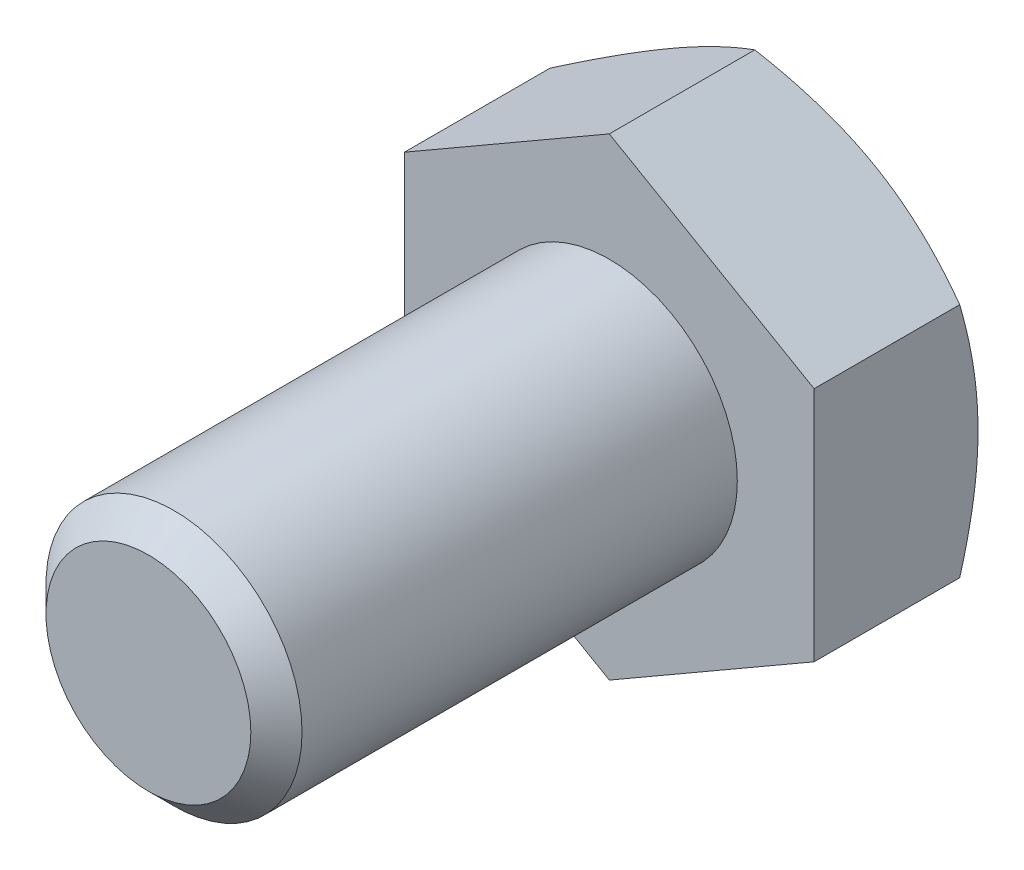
ISO-10303-21;
HEADER;
FILE_DESCRIPTION(('STEP AP214'),'2;1');
FILE_NAME('part.step','',(''),(''),'','','');
FILE_SCHEMA(('AUTOMOTIVE_DESIGN { 1 0 10303 214 1 1 1 1 }'));
ENDSEC;
DATA;
#1=APPLICATION_CONTEXT('core data for automotive mechanical design processes');
#2=APPLICATION_PROTOCOL_DEFINITION('international standard','automotive_design',2000,#1);
#3=PRODUCT_CONTEXT('',#1,'mechanical');
#4=PRODUCT('Part','Part','',(#3));
#5=PRODUCT_RELATED_PRODUCT_CATEGORY('part','',(#4));
#6=PRODUCT_DEFINITION_FORMATION('','',#4);
#7=PRODUCT_DEFINITION_CONTEXT('part definition',#1,'design');
#8=PRODUCT_DEFINITION('design','',#6,#7);
#9=PRODUCT_DEFINITION_SHAPE('','',#8);
#10=(LENGTH_UNIT() NAMED_UNIT(*) SI_UNIT(.MILLI.,.METRE.));
#11=(NAMED_UNIT(*) PLANE_ANGLE_UNIT() SI_UNIT($,.RADIAN.));
#12=(NAMED_UNIT(*) SI_UNIT($,.STERADIAN.) SOLID_ANGLE_UNIT());
#13=UNCERTAINTY_MEASURE_WITH_UNIT(LENGTH_MEASURE(1.E-05),#10,'distance_accuracy_value','');
#14=(GEOMETRIC_REPRESENTATION_CONTEXT(3) GLOBAL_UNCERTAINTY_ASSIGNED_CONTEXT((#13)) GLOBAL_UNIT_ASSIGNED_CONTEXT((#10,
#11,#12)) REPRESENTATION_CONTEXT('',''));
#15=CARTESIAN_POINT('',(0.,0.,0.));
#16=DIRECTION('',(0.,0.,1.));
#17=DIRECTION('',(1.,0.,0.));
#18=AXIS2_PLACEMENT_3D('',#15,#16,#17);
#19=CARTESIAN_POINT('',(0.,0.,18.));
#20=DIRECTION('',(0.,0.,1.));
#21=DIRECTION('',(1.,0.,0.));
#22=AXIS2_PLACEMENT_3D('',#19,#20,#21);
#23=PLANE('',#22);
#24=CARTESIAN_POINT('',(0.,0.,18.));
#25=DIRECTION('',(0.,0.,1.));
#26=DIRECTION('',(1.,0.,0.));
#27=AXIS2_PLACEMENT_3D('',#24,#25,#26);
#28=CIRCLE('',#27,4.);
#29=CARTESIAN_POINT('',(4.,0.,18.));
#30=VERTEX_POINT('',#29);
#31=EDGE_CURVE('E205',#30,#30,#28,.T.);
#32=ORIENTED_EDGE('',*,*,#31,.T.);
#33=EDGE_LOOP('',(#32));
#34=FACE_BOUND('',#33,.T.);
#35=ADVANCED_FACE('F31',(#34),#23,.T.);
#36=CARTESIAN_POINT('',(0.,0.,0.));
#37=DIRECTION('',(0.,0.,1.));
#38=DIRECTION('',(1.,0.,0.));
#39=AXIS2_PLACEMENT_3D('',#36,#37,#38);
#40=CYLINDRICAL_SURFACE('',#39,5.);
#41=CARTESIAN_POINT('',(0.,0.,17.));
#42=DIRECTION('',(0.,0.,1.));
#43=DIRECTION('',(1.,0.,0.));
#44=AXIS2_PLACEMENT_3D('',#41,#42,#43);
#45=CIRCLE('',#44,5.);
#46=CARTESIAN_POINT('',(5.,0.,17.));
#47=VERTEX_POINT('',#46);
#48=EDGE_CURVE('E207',#47,#47,#45,.F.);
#49=ORIENTED_EDGE('',*,*,#48,.T.);
#50=EDGE_LOOP('',(#49));
#51=FACE_BOUND('',#50,.T.);
#52=CARTESIAN_POINT('',(0.,0.,0.));
#53=DIRECTION('',(0.,0.,1.));
#54=DIRECTION('',(1.,0.,0.));
#55=AXIS2_PLACEMENT_3D('',#52,#53,#54);
#56=CIRCLE('',#55,5.);
#57=CARTESIAN_POINT('',(5.,0.,0.));
#58=VERTEX_POINT('',#57);
#59=EDGE_CURVE('E208',#58,#58,#56,.F.);
#60=ORIENTED_EDGE('',*,*,#59,.F.);
#61=EDGE_LOOP('',(#60));
#62=FACE_BOUND('',#61,.T.);
#63=ADVANCED_FACE('F196',(#51,#62),#40,.T.);
#64=CARTESIAN_POINT('',(0.,0.,18.));
#65=DIRECTION('',(0.,0.,-1.));
#66=DIRECTION('',(-1.,0.,0.));
#67=AXIS2_PLACEMENT_3D('',#64,#65,#66);
#68=CONICAL_SURFACE('',#67,4.,0.785398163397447);
#69=ORIENTED_EDGE('',*,*,#48,.F.);
#70=EDGE_LOOP('',(#69));
#71=FACE_BOUND('',#70,.T.);
#72=ORIENTED_EDGE('',*,*,#31,.F.);
#73=EDGE_LOOP('',(#72));
#74=FACE_BOUND('',#73,.T.);
#75=ADVANCED_FACE('F201',(#71,#74),#68,.T.);
#76=CARTESIAN_POINT('',(0.,9.23760430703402,-6.4));
#77=DIRECTION('',(0.499999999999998,0.86602540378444,0.));
#78=DIRECTION('',(-0.86602540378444,0.499999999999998,0.));
#79=AXIS2_PLACEMENT_3D('',#76,#77,#78);
#80=PLANE('',#79);
#81=CARTESIAN_POINT('',(-0.000200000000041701,9.23771977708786,-5.68540215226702));
#82=CARTESIAN_POINT('',(0.175648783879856,9.13619343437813,-5.74400928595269));
#83=CARTESIAN_POINT('',(0.352153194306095,9.03428856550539,-5.7999565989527));
#84=CARTESIAN_POINT('',(0.70659546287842,8.82965122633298,-5.90579899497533));
#85=CARTESIAN_POINT('',(0.884533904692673,8.72691841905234,-5.95569146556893));
#86=CARTESIAN_POINT('',(1.42119823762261,8.41707512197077,-6.09530720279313));
#87=CARTESIAN_POINT('',(1.78204258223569,8.20874154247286,-6.17471882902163));
#88=CARTESIAN_POINT('',(2.32203917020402,7.89697436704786,-6.26783835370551));
#89=CARTESIAN_POINT('',(2.49957818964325,7.79447216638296,-6.29436541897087));
#90=CARTESIAN_POINT('',(2.85545911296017,7.58900421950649,-6.33884682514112));
#91=CARTESIAN_POINT('',(3.03380094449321,7.48603851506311,-6.35680192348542));
#92=CARTESIAN_POINT('',(3.39079168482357,7.27992981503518,-6.38368435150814));
#93=CARTESIAN_POINT('',(3.56944001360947,7.17678715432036,-6.39262192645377));
#94=CARTESIAN_POINT('',(3.92690170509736,6.97040655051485,-6.40127769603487));
#95=CARTESIAN_POINT('',(4.10571506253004,6.86716861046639,-6.40099617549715));
#96=CARTESIAN_POINT('',(4.44001336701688,6.67416139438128,-6.39185497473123));
#97=CARTESIAN_POINT('',(4.59552190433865,6.58437849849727,-6.38411039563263));
#98=CARTESIAN_POINT('',(4.90617476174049,6.4050229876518,-6.36179886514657));
#99=CARTESIAN_POINT('',(5.06131905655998,6.31545038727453,-6.34723145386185));
#100=CARTESIAN_POINT('',(5.5261513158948,6.04707935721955,-6.29363930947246));
#101=CARTESIAN_POINT('',(5.8350164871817,5.86875596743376,-6.24473135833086));
#102=CARTESIAN_POINT('',(6.45602322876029,5.51021755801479,-6.12246059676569));
#103=CARTESIAN_POINT('',(6.76808554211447,5.33004829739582,-6.048579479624));
#104=CARTESIAN_POINT('',(7.38755648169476,4.97239658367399,-5.88089985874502));
#105=CARTESIAN_POINT('',(7.69497304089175,4.79490955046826,-5.78714073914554));
#106=CARTESIAN_POINT('',(8.0002,4.61868668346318,-5.68540215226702));
#107=B_SPLINE_CURVE_WITH_KNOTS('',3,(#81,#82,#83,#84,#85,#86,#87,#88,#89,#90,#91,#92,#93,#94,
#95,#96,#97,#98,#99,#100,#101,#102,#103,#104,#105,#106),.UNSPECIFIED.,.F.,.F.,(4,2,2,2,2,2,2,2,
2,2,2,2,4),(0.,0.633973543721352,1.26821965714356,2.53934712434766,3.1593434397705,
3.77928496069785,4.39852133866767,5.01773858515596,5.5568023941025,6.09590254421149,
7.17487077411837,8.27776850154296,9.37850115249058),.UNSPECIFIED.);
#108=CARTESIAN_POINT('',(0.,9.23760430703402,-5.68546882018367));
#109=VERTEX_POINT('',#108);
#110=CARTESIAN_POINT('',(3.99999999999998,6.92820323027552,-6.4));
#111=VERTEX_POINT('',#110);
#112=EDGE_CURVE('E241',#109,#111,#107,.T.);
#113=ORIENTED_EDGE('',*,*,#112,.F.);
#114=DIRECTION('',(0.,0.,1.));
#115=VECTOR('',#114,1.);
#116=CARTESIAN_POINT('',(0.,9.23760430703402,-6.4));
#117=LINE('',#116,#115);
#118=CARTESIAN_POINT('',(0.,9.23760430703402,0.));
#119=VERTEX_POINT('',#118);
#120=EDGE_CURVE('E215',#109,#119,#117,.T.);
#121=ORIENTED_EDGE('',*,*,#120,.T.);
#122=DIRECTION('',(-0.86602540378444,0.499999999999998,0.));
#123=VECTOR('',#122,1.);
#124=CARTESIAN_POINT('',(0.,9.23760430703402,0.));
#125=LINE('',#124,#123);
#126=CARTESIAN_POINT('',(8.,4.61880215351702,0.));
#127=VERTEX_POINT('',#126);
#128=EDGE_CURVE('E239',#127,#119,#125,.T.);
#129=ORIENTED_EDGE('',*,*,#128,.F.);
#130=DIRECTION('',(0.,0.,1.));
#131=VECTOR('',#130,1.);
#132=CARTESIAN_POINT('',(8.,4.61880215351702,-6.4));
#133=LINE('',#132,#131);
#134=CARTESIAN_POINT('',(8.,4.61880215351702,-5.68546882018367));
#135=VERTEX_POINT('',#134);
#136=EDGE_CURVE('E212',#135,#127,#133,.T.);
#137=ORIENTED_EDGE('',*,*,#136,.F.);
#138=EDGE_CURVE('E171',#111,#135,#107,.T.);
#139=ORIENTED_EDGE('',*,*,#138,.F.);
#140=EDGE_LOOP('',(#113,#121,#129,#137,#139));
#141=FACE_BOUND('',#140,.T.);
#142=ADVANCED_FACE('F181',(#141),#80,.T.);
#143=CARTESIAN_POINT('',(8.,-4.61880215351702,-6.4));
#144=DIRECTION('',(1.,0.,0.));
#145=DIRECTION('',(0.,0.,-1.));
#146=AXIS2_PLACEMENT_3D('',#143,#144,#145);
#147=PLANE('',#146);
#148=CARTESIAN_POINT('',(8.,-12.5978512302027,-2.40281206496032));
#149=CARTESIAN_POINT('',(8.,-12.246746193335,-2.57388946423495));
#150=CARTESIAN_POINT('',(8.,-11.8948553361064,-2.74338074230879));
#151=CARTESIAN_POINT('',(8.,-11.1890846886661,-3.07830251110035));
#152=CARTESIAN_POINT('',(8.,-10.835204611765,-3.24373239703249));
#153=CARTESIAN_POINT('',(8.,-10.1233054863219,-3.57043443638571));
#154=CARTESIAN_POINT('',(8.,-9.76527449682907,-3.73168065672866));
#155=CARTESIAN_POINT('',(8.,-9.04643054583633,-4.04782365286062));
#156=CARTESIAN_POINT('',(8.,-8.68561771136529,-4.20272071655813));
#157=CARTESIAN_POINT('',(8.,-7.94836823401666,-4.50960168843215));
#158=CARTESIAN_POINT('',(8.,-7.57181608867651,-4.66130959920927));
#159=CARTESIAN_POINT('',(8.,-6.81437869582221,-4.95369969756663));
#160=CARTESIAN_POINT('',(8.,-6.43349297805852,-5.09438067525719));
#161=CARTESIAN_POINT('',(8.,-5.66743059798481,-5.36116349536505));
#162=CARTESIAN_POINT('',(8.,-5.28226375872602,-5.48729325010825));
#163=CARTESIAN_POINT('',(8.,-4.50642197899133,-5.72105487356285));
#164=CARTESIAN_POINT('',(8.,-4.11574875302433,-5.82869236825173));
#165=CARTESIAN_POINT('',(8.,-3.33076858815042,-6.01985550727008));
#166=CARTESIAN_POINT('',(8.,-2.9364953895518,-6.10351603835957));
#167=CARTESIAN_POINT('',(8.,-2.34134760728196,-6.20749259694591));
#168=CARTESIAN_POINT('',(8.,-2.14232908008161,-6.23856705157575));
#169=CARTESIAN_POINT('',(8.,-1.7432391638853,-6.29294025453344));
#170=CARTESIAN_POINT('',(8.,-1.54316787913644,-6.31623975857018));
#171=CARTESIAN_POINT('',(8.,-1.14493807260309,-6.35429623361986));
#172=CARTESIAN_POINT('',(8.,-0.946790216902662,-6.36916434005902));
#173=CARTESIAN_POINT('',(8.,-0.550042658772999,-6.39050002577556));
#174=CARTESIAN_POINT('',(8.,-0.351442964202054,-6.39696775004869));
#175=CARTESIAN_POINT('',(8.,0.0458536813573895,-6.40134753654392));
#176=CARTESIAN_POINT('',(8.,0.244550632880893,-6.39925955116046));
#177=CARTESIAN_POINT('',(8.,0.641675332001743,-6.38658102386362));
#178=CARTESIAN_POINT('',(8.,0.840103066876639,-6.37599009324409));
#179=CARTESIAN_POINT('',(8.,1.31123186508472,-6.3409781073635));
#180=CARTESIAN_POINT('',(8.,1.58366327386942,-6.31284309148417));
#181=CARTESIAN_POINT('',(8.,2.12661564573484,-6.24203710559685));
#182=CARTESIAN_POINT('',(8.,2.39713636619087,-6.19936432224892));
#183=CARTESIAN_POINT('',(8.,3.20545284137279,-6.0517930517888));
#184=CARTESIAN_POINT('',(8.,3.73973646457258,-5.92736416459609));
#185=CARTESIAN_POINT('',(8.,4.53906436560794,-5.71012995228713));
#186=CARTESIAN_POINT('',(8.,4.80821183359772,-5.63154182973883));
#187=CARTESIAN_POINT('',(8.,5.34389592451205,-5.46584170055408));
#188=CARTESIAN_POINT('',(8.,5.61043252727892,-5.37872962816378));
#189=CARTESIAN_POINT('',(8.,6.14097486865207,-5.1974091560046));
#190=CARTESIAN_POINT('',(8.,6.40498129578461,-5.10320275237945));
#191=CARTESIAN_POINT('',(8.,6.93077992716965,-4.90883812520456));
#192=CARTESIAN_POINT('',(8.,7.19257218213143,-4.8086800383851));
#193=CARTESIAN_POINT('',(8.,7.89757234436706,-4.53123135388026));
#194=CARTESIAN_POINT('',(8.,8.33892089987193,-4.34922056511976));
#195=CARTESIAN_POINT('',(8.,9.21706508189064,-3.97449001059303));
#196=CARTESIAN_POINT('',(8.,9.6538601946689,-3.78176905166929));
#197=CARTESIAN_POINT('',(8.,10.5239434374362,-3.38815487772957));
#198=CARTESIAN_POINT('',(8.,10.9572301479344,-3.18725853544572));
#199=CARTESIAN_POINT('',(8.,11.8208356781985,-2.77925077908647));
#200=CARTESIAN_POINT('',(8.,12.251154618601,-2.57213961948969));
#201=CARTESIAN_POINT('',(8.,13.1101061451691,-2.15271844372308));
#202=CARTESIAN_POINT('',(8.,13.5387348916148,-1.94040058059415));
#203=CARTESIAN_POINT('',(8.,14.3940561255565,-1.51189757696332));
#204=CARTESIAN_POINT('',(8.,14.8207485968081,-1.29571240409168));
#205=CARTESIAN_POINT('',(8.,15.672448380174,-0.860283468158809));
#206=CARTESIAN_POINT('',(8.,16.0974560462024,-0.641040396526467));
#207=CARTESIAN_POINT('',(8.,16.9461557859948,-0.200021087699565));
#208=CARTESIAN_POINT('',(8.,17.3698478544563,0.0217551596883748));
#209=CARTESIAN_POINT('',(8.,18.5495919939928,0.642968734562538));
#210=CARTESIAN_POINT('',(8.,19.3044430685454,1.04468640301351));
#211=CARTESIAN_POINT('',(8.,20.8116128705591,1.85294502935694));
#212=CARTESIAN_POINT('',(8.,21.5639314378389,2.25948628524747));
#213=CARTESIAN_POINT('',(8.,23.0640825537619,3.07479055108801));
#214=CARTESIAN_POINT('',(8.,23.8119216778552,3.48354147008));
#215=CARTESIAN_POINT('',(8.,24.9325210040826,4.09870759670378));
#216=CARTESIAN_POINT('',(8.,25.3058462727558,4.30409483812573));
#217=CARTESIAN_POINT('',(8.,26.0521604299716,4.71547851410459));
#218=CARTESIAN_POINT('',(8.,26.4251493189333,4.92147494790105));
#219=CARTESIAN_POINT('',(8.,26.7979906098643,5.12773824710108));
#220=B_SPLINE_CURVE_WITH_KNOTS('',3,(#148,#149,#150,#151,#152,#153,#154,#155,#156,#157,#158,
#159,#160,#161,#162,#163,#164,#165,#166,#167,#168,#169,#170,#171,#172,#173,#174,#175,#176,#177,
#178,#179,#180,#181,#182,#183,#184,#185,#186,#187,#188,#189,#190,#191,#192,#193,#194,#195,#196,
#197,#198,#199,#200,#201,#202,#203,#204,#205,#206,#207,#208,#209,#210,#211,#212,#213,#214,#215,
#216,#217,#218,#219),.UNSPECIFIED.,.F.,.F.,(4,2,2,2,2,2,2,2,2,2,2,2,2,2,2,2,2,2,2,2,2,2,2,2,2,2,
2,2,2,2,2,2,2,2,2,4),(0.,1.17171303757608,2.34359951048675,3.52154779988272,4.69944261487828,
5.91720060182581,7.13509201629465,8.35060698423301,9.56575149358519,10.7739194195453,
11.3780811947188,11.982184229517,12.5781274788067,13.1740604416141,13.7699967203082,
14.3659602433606,15.1871414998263,16.0084252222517,17.651791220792,18.4928743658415,
19.3339639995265,20.1748178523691,21.0156523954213,22.4476587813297,23.8798250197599,
25.312544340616,26.7452050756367,28.1801767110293,29.6151603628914,31.0498246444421,
32.48449470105,35.0497345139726,37.6151336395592,40.1718943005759,41.4501744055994,
42.7284529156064),.UNSPECIFIED.);
#221=CARTESIAN_POINT('',(8.,0.,-6.4));
#222=VERTEX_POINT('',#221);
#223=EDGE_CURVE('E169',#135,#222,#220,.F.);
#224=ORIENTED_EDGE('',*,*,#223,.F.);
#225=ORIENTED_EDGE('',*,*,#136,.T.);
#226=DIRECTION('',(0.,1.,0.));
#227=VECTOR('',#226,1.);
#228=CARTESIAN_POINT('',(8.,-4.61880215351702,0.));
#229=LINE('',#228,#227);
#230=CARTESIAN_POINT('',(8.,-4.61880215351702,0.));
#231=VERTEX_POINT('',#230);
#232=EDGE_CURVE('E217',#231,#127,#229,.T.);
#233=ORIENTED_EDGE('',*,*,#232,.F.);
#234=DIRECTION('',(0.,0.,1.));
#235=VECTOR('',#234,1.);
#236=CARTESIAN_POINT('',(8.,-4.61880215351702,-6.4));
#237=LINE('',#236,#235);
#238=CARTESIAN_POINT('',(8.,-4.61880215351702,-5.68546882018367));
#239=VERTEX_POINT('',#238);
#240=EDGE_CURVE('E223',#239,#231,#237,.T.);
#241=ORIENTED_EDGE('',*,*,#240,.F.);
#242=EDGE_CURVE('E164',#222,#239,#220,.F.);
#243=ORIENTED_EDGE('',*,*,#242,.F.);
#244=EDGE_LOOP('',(#224,#225,#233,#241,#243));
#245=FACE_BOUND('',#244,.T.);
#246=ADVANCED_FACE('F177',(#245),#147,.T.);
#247=CARTESIAN_POINT('',(0.,-9.23760430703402,-6.4));
#248=DIRECTION('',(0.499999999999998,-0.86602540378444,0.));
#249=DIRECTION('',(0.86602540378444,0.499999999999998,0.));
#250=AXIS2_PLACEMENT_3D('',#247,#248,#249);
#251=PLANE('',#250);
#252=CARTESIAN_POINT('',(8.0002,-4.61868668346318,-5.68540215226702));
#253=CARTESIAN_POINT('',(7.8243512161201,-4.72021302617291,-5.74400928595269));
#254=CARTESIAN_POINT('',(7.64784680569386,-4.82211789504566,-5.7999565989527));
#255=CARTESIAN_POINT('',(7.29340453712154,-5.02675523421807,-5.90579899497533));
#256=CARTESIAN_POINT('',(7.11546609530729,-5.12948804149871,-5.95569146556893));
#257=CARTESIAN_POINT('',(6.57880176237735,-5.43933133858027,-6.09530720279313));
#258=CARTESIAN_POINT('',(6.21795741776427,-5.64766491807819,-6.17471882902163));
#259=CARTESIAN_POINT('',(5.67796082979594,-5.95943209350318,-6.26783835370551));
#260=CARTESIAN_POINT('',(5.50042181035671,-6.06193429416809,-6.29436541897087));
#261=CARTESIAN_POINT('',(5.14454088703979,-6.26740224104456,-6.33884682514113));
#262=CARTESIAN_POINT('',(4.96619905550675,-6.37036794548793,-6.35680192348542));
#263=CARTESIAN_POINT('',(4.60920831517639,-6.57647664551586,-6.38368435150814));
#264=CARTESIAN_POINT('',(4.43055998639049,-6.67961930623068,-6.39262192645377));
#265=CARTESIAN_POINT('',(4.0730982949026,-6.88599991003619,-6.40127769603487));
#266=CARTESIAN_POINT('',(3.89428493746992,-6.98923785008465,-6.40099617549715));
#267=CARTESIAN_POINT('',(3.55998663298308,-7.18224506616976,-6.39185497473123));
#268=CARTESIAN_POINT('',(3.40447809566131,-7.27202796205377,-6.38411039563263));
#269=CARTESIAN_POINT('',(3.09382523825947,-7.45138347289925,-6.36179886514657));
#270=CARTESIAN_POINT('',(2.93868094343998,-7.54095607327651,-6.34723145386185));
#271=CARTESIAN_POINT('',(2.47384868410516,-7.80932710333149,-6.29363930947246));
#272=CARTESIAN_POINT('',(2.16498351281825,-7.98765049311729,-6.24473135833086));
#273=CARTESIAN_POINT('',(1.54397677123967,-8.34618890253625,-6.12246059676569));
#274=CARTESIAN_POINT('',(1.23191445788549,-8.52635816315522,-6.048579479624));
#275=CARTESIAN_POINT('',(0.612443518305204,-8.88400987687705,-5.88089985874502));
#276=CARTESIAN_POINT('',(0.30502695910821,-9.06149691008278,-5.78714073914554));
#277=CARTESIAN_POINT('',(-0.0002000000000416,-9.23771977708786,-5.68540215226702));
#278=B_SPLINE_CURVE_WITH_KNOTS('',3,(#252,#253,#254,#255,#256,#257,#258,#259,#260,#261,#262,
#263,#264,#265,#266,#267,#268,#269,#270,#271,#272,#273,#274,#275,#276,#277),.UNSPECIFIED.,.F.,
.F.,(4,2,2,2,2,2,2,2,2,2,2,2,4),(0.,0.633973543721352,1.26821965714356,2.53934712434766,
3.1593434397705,3.77928496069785,4.39852133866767,5.01773858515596,5.5568023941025,
6.09590254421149,7.17487077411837,8.27776850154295,9.37850115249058),.UNSPECIFIED.);
#279=CARTESIAN_POINT('',(3.99999999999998,-6.92820323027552,-6.4));
#280=VERTEX_POINT('',#279);
#281=EDGE_CURVE('E170',#239,#280,#278,.T.);
#282=ORIENTED_EDGE('',*,*,#281,.F.);
#283=ORIENTED_EDGE('',*,*,#240,.T.);
#284=DIRECTION('',(0.86602540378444,0.499999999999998,0.));
#285=VECTOR('',#284,1.);
#286=CARTESIAN_POINT('',(0.,-9.23760430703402,0.));
#287=LINE('',#286,#285);
#288=CARTESIAN_POINT('',(0.,-9.23760430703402,0.));
#289=VERTEX_POINT('',#288);
#290=EDGE_CURVE('E228',#289,#231,#287,.T.);
#291=ORIENTED_EDGE('',*,*,#290,.F.);
#292=DIRECTION('',(0.,0.,1.));
#293=VECTOR('',#292,1.);
#294=CARTESIAN_POINT('',(0.,-9.23760430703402,-6.4));
#295=LINE('',#294,#293);
#296=CARTESIAN_POINT('',(0.,-9.23760430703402,-5.68546882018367));
#297=VERTEX_POINT('',#296);
#298=EDGE_CURVE('E221',#297,#289,#295,.T.);
#299=ORIENTED_EDGE('',*,*,#298,.F.);
#300=EDGE_CURVE('E158',#280,#297,#278,.T.);
#301=ORIENTED_EDGE('',*,*,#300,.F.);
#302=EDGE_LOOP('',(#282,#283,#291,#299,#301));
#303=FACE_BOUND('',#302,.T.);
#304=ADVANCED_FACE('F180',(#303),#251,.T.);
#305=CARTESIAN_POINT('',(0.,-9.23760430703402,-6.4));
#306=DIRECTION('',(-0.500000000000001,-0.866025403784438,0.));
#307=DIRECTION('',(0.866025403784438,-0.500000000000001,0.));
#308=AXIS2_PLACEMENT_3D('',#305,#306,#307);
#309=PLANE('',#308);
#310=CARTESIAN_POINT('',(0.000199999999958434,-9.23771977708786,-5.68540215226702));
#311=CARTESIAN_POINT('',(-0.175648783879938,-9.13619343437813,-5.74400928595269));
#312=CARTESIAN_POINT('',(-0.352153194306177,-9.03428856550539,-5.7999565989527));
#313=CARTESIAN_POINT('',(-0.706595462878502,-8.82965122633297,-5.90579899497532));
#314=CARTESIAN_POINT('',(-0.884533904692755,-8.72691841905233,-5.95569146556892));
#315=CARTESIAN_POINT('',(-1.42119823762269,-8.41707512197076,-6.09530720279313));
#316=CARTESIAN_POINT('',(-1.78204258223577,-8.20874154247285,-6.17471882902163));
#317=CARTESIAN_POINT('',(-2.3220391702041,-7.89697436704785,-6.2678383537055));
#318=CARTESIAN_POINT('',(-2.49957818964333,-7.79447216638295,-6.29436541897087));
#319=CARTESIAN_POINT('',(-2.85545911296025,-7.58900421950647,-6.33884682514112));
#320=CARTESIAN_POINT('',(-3.03380094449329,-7.4860385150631,-6.35680192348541));
#321=CARTESIAN_POINT('',(-3.39079168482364,-7.27992981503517,-6.38368435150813));
#322=CARTESIAN_POINT('',(-3.56944001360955,-7.17678715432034,-6.39262192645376));
#323=CARTESIAN_POINT('',(-3.92690170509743,-6.97040655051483,-6.40127769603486));
#324=CARTESIAN_POINT('',(-4.10571506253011,-6.86716861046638,-6.40099617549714));
#325=CARTESIAN_POINT('',(-4.44001336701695,-6.67416139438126,-6.39185497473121));
#326=CARTESIAN_POINT('',(-4.59552190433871,-6.58437849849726,-6.38411039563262));
#327=CARTESIAN_POINT('',(-4.90617476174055,-6.40502298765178,-6.36179886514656));
#328=CARTESIAN_POINT('',(-5.06131905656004,-6.31545038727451,-6.34723145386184));
#329=CARTESIAN_POINT('',(-5.52615131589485,-6.04707935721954,-6.29363930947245));
#330=CARTESIAN_POINT('',(-5.83501648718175,-5.86875596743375,-6.24473135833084));
#331=CARTESIAN_POINT('',(-6.45602322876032,-5.51021755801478,-6.12246059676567));
#332=CARTESIAN_POINT('',(-6.76808554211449,-5.33004829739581,-6.04857947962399));
#333=CARTESIAN_POINT('',(-7.38755648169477,-4.97239658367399,-5.88089985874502));
#334=CARTESIAN_POINT('',(-7.69497304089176,-4.79490955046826,-5.78714073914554));
#335=CARTESIAN_POINT('',(-8.0002,-4.61868668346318,-5.68540215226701));
#336=B_SPLINE_CURVE_WITH_KNOTS('',3,(#310,#311,#312,#313,#314,#315,#316,#317,#318,#319,#320,
#321,#322,#323,#324,#325,#326,#327,#328,#329,#330,#331,#332,#333,#334,#335),.UNSPECIFIED.,.F.,
.F.,(4,2,2,2,2,2,2,2,2,2,2,2,4),(0.,0.633973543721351,1.26821965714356,2.53934712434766,
3.1593434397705,3.77928496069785,4.39852133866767,5.01773858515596,5.55680239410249,
6.09590254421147,7.17487077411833,8.2777685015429,9.37850115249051),.UNSPECIFIED.);
#337=CARTESIAN_POINT('',(-4.00000000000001,-6.9282032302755,-6.4));
#338=VERTEX_POINT('',#337);
#339=EDGE_CURVE('E260',#297,#338,#336,.T.);
#340=ORIENTED_EDGE('',*,*,#339,.F.);
#341=ORIENTED_EDGE('',*,*,#298,.T.);
#342=DIRECTION('',(0.866025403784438,-0.500000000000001,0.));
#343=VECTOR('',#342,1.);
#344=CARTESIAN_POINT('',(0.,-9.23760430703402,0.));
#345=LINE('',#344,#343);
#346=CARTESIAN_POINT('',(-8.,-4.61880215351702,0.));
#347=VERTEX_POINT('',#346);
#348=EDGE_CURVE('E231',#347,#289,#345,.T.);
#349=ORIENTED_EDGE('',*,*,#348,.F.);
#350=DIRECTION('',(0.,0.,1.));
#351=VECTOR('',#350,1.);
#352=CARTESIAN_POINT('',(-8.,-4.61880215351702,-6.4));
#353=LINE('',#352,#351);
#354=CARTESIAN_POINT('',(-8.,-4.61880215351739,-5.68546882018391));
#355=VERTEX_POINT('',#354);
#356=EDGE_CURVE('E219',#355,#347,#353,.T.);
#357=ORIENTED_EDGE('',*,*,#356,.F.);
#358=EDGE_CURVE('E107',#338,#355,#336,.T.);
#359=ORIENTED_EDGE('',*,*,#358,.F.);
#360=EDGE_LOOP('',(#340,#341,#349,#357,#359));
#361=FACE_BOUND('',#360,.T.);
#362=ADVANCED_FACE('F185',(#361),#309,.T.);
#363=CARTESIAN_POINT('',(-8.,-4.61880215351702,-6.4));
#364=DIRECTION('',(-1.,0.,0.));
#365=DIRECTION('',(0.,0.,1.));
#366=AXIS2_PLACEMENT_3D('',#363,#364,#365);
#367=PLANE('',#366);
#368=CARTESIAN_POINT('',(-8.,-12.5978512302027,-2.40281206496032));
#369=CARTESIAN_POINT('',(-8.,-12.246746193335,-2.57388946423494));
#370=CARTESIAN_POINT('',(-8.,-11.8948553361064,-2.74338074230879));
#371=CARTESIAN_POINT('',(-8.,-11.1890846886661,-3.07830251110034));
#372=CARTESIAN_POINT('',(-8.,-10.835204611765,-3.24373239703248));
#373=CARTESIAN_POINT('',(-8.,-10.1233054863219,-3.57043443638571));
#374=CARTESIAN_POINT('',(-8.,-9.76527449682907,-3.73168065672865));
#375=CARTESIAN_POINT('',(-8.,-9.04643054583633,-4.04782365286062));
#376=CARTESIAN_POINT('',(-8.,-8.68561771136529,-4.20272071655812));
#377=CARTESIAN_POINT('',(-8.,-7.94836823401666,-4.50960168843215));
#378=CARTESIAN_POINT('',(-8.,-7.57181608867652,-4.66130959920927));
#379=CARTESIAN_POINT('',(-8.,-6.81437869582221,-4.95369969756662));
#380=CARTESIAN_POINT('',(-8.,-6.43349297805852,-5.09438067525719));
#381=CARTESIAN_POINT('',(-8.,-5.66743059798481,-5.36116349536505));
#382=CARTESIAN_POINT('',(-8.,-5.28226375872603,-5.48729325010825));
#383=CARTESIAN_POINT('',(-8.,-4.50642197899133,-5.72105487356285));
#384=CARTESIAN_POINT('',(-8.,-4.11574875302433,-5.82869236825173));
#385=CARTESIAN_POINT('',(-8.,-3.33076858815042,-6.01985550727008));
#386=CARTESIAN_POINT('',(-8.,-2.9364953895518,-6.10351603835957));
#387=CARTESIAN_POINT('',(-8.,-2.34134760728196,-6.20749259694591));
#388=CARTESIAN_POINT('',(-8.,-2.1423290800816,-6.23856705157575));
#389=CARTESIAN_POINT('',(-8.,-1.7432391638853,-6.29294025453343));
#390=CARTESIAN_POINT('',(-8.,-1.54316787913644,-6.31623975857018));
#391=CARTESIAN_POINT('',(-8.,-1.14493807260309,-6.35429623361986));
#392=CARTESIAN_POINT('',(-8.,-0.94679021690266,-6.36916434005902));
#393=CARTESIAN_POINT('',(-8.,-0.550042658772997,-6.39050002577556));
#394=CARTESIAN_POINT('',(-8.,-0.351442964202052,-6.39696775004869));
#395=CARTESIAN_POINT('',(-8.,0.045853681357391,-6.40134753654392));
#396=CARTESIAN_POINT('',(-8.,0.244550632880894,-6.39925955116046));
#397=CARTESIAN_POINT('',(-8.,0.641675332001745,-6.38658102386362));
#398=CARTESIAN_POINT('',(-8.,0.84010306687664,-6.37599009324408));
#399=CARTESIAN_POINT('',(-8.,1.31123186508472,-6.3409781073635));
#400=CARTESIAN_POINT('',(-8.,1.58366327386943,-6.31284309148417));
#401=CARTESIAN_POINT('',(-8.,2.12661564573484,-6.24203710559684));
#402=CARTESIAN_POINT('',(-8.,2.39713636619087,-6.19936432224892));
#403=CARTESIAN_POINT('',(-8.,3.20545284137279,-6.0517930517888));
#404=CARTESIAN_POINT('',(-8.,3.73973646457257,-5.9273641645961));
#405=CARTESIAN_POINT('',(-8.,4.53906436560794,-5.71012995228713));
#406=CARTESIAN_POINT('',(-8.,4.80821183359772,-5.63154182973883));
#407=CARTESIAN_POINT('',(-8.,5.34389592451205,-5.46584170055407));
#408=CARTESIAN_POINT('',(-8.,5.61043252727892,-5.37872962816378));
#409=CARTESIAN_POINT('',(-8.,6.14097486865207,-5.1974091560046));
#410=CARTESIAN_POINT('',(-8.,6.40498129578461,-5.10320275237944));
#411=CARTESIAN_POINT('',(-8.,6.93077992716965,-4.90883812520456));
#412=CARTESIAN_POINT('',(-8.,7.19257218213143,-4.8086800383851));
#413=CARTESIAN_POINT('',(-8.,7.89757234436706,-4.53123135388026));
#414=CARTESIAN_POINT('',(-8.,8.33892089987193,-4.34922056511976));
#415=CARTESIAN_POINT('',(-8.,9.21706508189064,-3.97449001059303));
#416=CARTESIAN_POINT('',(-8.,9.6538601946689,-3.78176905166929));
#417=CARTESIAN_POINT('',(-8.,10.5239434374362,-3.38815487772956));
#418=CARTESIAN_POINT('',(-8.,10.9572301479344,-3.18725853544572));
#419=CARTESIAN_POINT('',(-8.,11.8208356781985,-2.77925077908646));
#420=CARTESIAN_POINT('',(-8.,12.251154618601,-2.57213961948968));
#421=CARTESIAN_POINT('',(-8.,13.1101061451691,-2.15271844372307));
#422=CARTESIAN_POINT('',(-8.,13.5387348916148,-1.94040058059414));
#423=CARTESIAN_POINT('',(-8.,14.3940561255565,-1.51189757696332));
#424=CARTESIAN_POINT('',(-8.,14.8207485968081,-1.29571240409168));
#425=CARTESIAN_POINT('',(-8.,15.672448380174,-0.860283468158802));
#426=CARTESIAN_POINT('',(-8.,16.0974560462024,-0.641040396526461));
#427=CARTESIAN_POINT('',(-8.,16.9461557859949,-0.20002108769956));
#428=CARTESIAN_POINT('',(-8.,17.3698478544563,0.0217551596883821));
#429=CARTESIAN_POINT('',(-8.,18.5495919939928,0.642968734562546));
#430=CARTESIAN_POINT('',(-8.,19.3044430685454,1.04468640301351));
#431=CARTESIAN_POINT('',(-8.,20.8116128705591,1.85294502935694));
#432=CARTESIAN_POINT('',(-8.,21.5639314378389,2.25948628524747));
#433=CARTESIAN_POINT('',(-8.,23.0640825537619,3.07479055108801));
#434=CARTESIAN_POINT('',(-8.,23.8119216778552,3.48354147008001));
#435=CARTESIAN_POINT('',(-8.,24.9325210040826,4.09870759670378));
#436=CARTESIAN_POINT('',(-8.,25.3058462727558,4.30409483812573));
#437=CARTESIAN_POINT('',(-8.,26.0521604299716,4.7154785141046));
#438=CARTESIAN_POINT('',(-8.,26.4251493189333,4.92147494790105));
#439=CARTESIAN_POINT('',(-8.,26.7979906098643,5.12773824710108));
#440=B_SPLINE_CURVE_WITH_KNOTS('',3,(#368,#369,#370,#371,#372,#373,#374,#375,#376,#377,#378,
#379,#380,#381,#382,#383,#384,#385,#386,#387,#388,#389,#390,#391,#392,#393,#394,#395,#396,#397,
#398,#399,#400,#401,#402,#403,#404,#405,#406,#407,#408,#409,#410,#411,#412,#413,#414,#415,#416,
#417,#418,#419,#420,#421,#422,#423,#424,#425,#426,#427,#428,#429,#430,#431,#432,#433,#434,#435,
#436,#437,#438,#439),.UNSPECIFIED.,.F.,.F.,(4,2,2,2,2,2,2,2,2,2,2,2,2,2,2,2,2,2,2,2,2,2,2,2,2,2,
2,2,2,2,2,2,2,2,2,4),(0.,1.17171303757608,2.34359951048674,3.52154779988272,4.69944261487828,
5.91720060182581,7.13509201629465,8.35060698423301,9.56575149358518,10.7739194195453,
11.3780811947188,11.982184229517,12.5781274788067,13.1740604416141,13.7699967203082,
14.3659602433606,15.1871414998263,16.0084252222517,17.651791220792,18.4928743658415,
19.3339639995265,20.1748178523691,21.0156523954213,22.4476587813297,23.8798250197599,
25.312544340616,26.7452050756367,28.1801767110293,29.6151603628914,31.0498246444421,
32.48449470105,35.0497345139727,37.6151336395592,40.1718943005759,41.4501744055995,
42.7284529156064),.UNSPECIFIED.);
#441=CARTESIAN_POINT('',(-8.,0.,-6.4));
#442=VERTEX_POINT('',#441);
#443=EDGE_CURVE('E102',#355,#442,#440,.T.);
#444=ORIENTED_EDGE('',*,*,#443,.F.);
#445=ORIENTED_EDGE('',*,*,#356,.T.);
#446=DIRECTION('',(0.,-1.,0.));
#447=VECTOR('',#446,1.);
#448=CARTESIAN_POINT('',(-8.,-4.61880215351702,0.));
#449=LINE('',#448,#447);
#450=CARTESIAN_POINT('',(-8.,4.61880215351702,0.));
#451=VERTEX_POINT('',#450);
#452=EDGE_CURVE('E234',#451,#347,#449,.T.);
#453=ORIENTED_EDGE('',*,*,#452,.F.);
#454=DIRECTION('',(0.,0.,1.));
#455=VECTOR('',#454,1.);
#456=CARTESIAN_POINT('',(-8.,4.61880215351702,-6.4));
#457=LINE('',#456,#455);
#458=CARTESIAN_POINT('',(-8.,4.61880215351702,-5.68546882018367));
#459=VERTEX_POINT('',#458);
#460=EDGE_CURVE('E128',#459,#451,#457,.T.);
#461=ORIENTED_EDGE('',*,*,#460,.F.);
#462=EDGE_CURVE('E111',#442,#459,#440,.T.);
#463=ORIENTED_EDGE('',*,*,#462,.F.);
#464=EDGE_LOOP('',(#444,#445,#453,#461,#463));
#465=FACE_BOUND('',#464,.T.);
#466=ADVANCED_FACE('F126',(#465),#367,.T.);
#467=CARTESIAN_POINT('',(-8.,4.61880215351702,-6.4));
#468=DIRECTION('',(-0.500000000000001,0.866025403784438,0.));
#469=DIRECTION('',(-0.866025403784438,-0.500000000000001,0.));
#470=AXIS2_PLACEMENT_3D('',#467,#468,#469);
#471=PLANE('',#470);
#472=CARTESIAN_POINT('',(-8.0002,4.61868668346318,-5.68540215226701));
#473=CARTESIAN_POINT('',(-7.8243512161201,4.72021302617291,-5.74400928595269));
#474=CARTESIAN_POINT('',(-7.64784680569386,4.82211789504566,-5.7999565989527));
#475=CARTESIAN_POINT('',(-7.29340453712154,5.02675523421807,-5.90579899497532));
#476=CARTESIAN_POINT('',(-7.11546609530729,5.12948804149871,-5.95569146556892));
#477=CARTESIAN_POINT('',(-6.57880176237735,5.43933133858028,-6.09530720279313));
#478=CARTESIAN_POINT('',(-6.21795741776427,5.6476649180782,-6.17471882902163));
#479=CARTESIAN_POINT('',(-5.67796082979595,5.95943209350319,-6.2678383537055));
#480=CARTESIAN_POINT('',(-5.50042181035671,6.0619342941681,-6.29436541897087));
#481=CARTESIAN_POINT('',(-5.1445408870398,6.26740224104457,-6.33884682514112));
#482=CARTESIAN_POINT('',(-4.96619905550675,6.37036794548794,-6.35680192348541));
#483=CARTESIAN_POINT('',(-4.6092083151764,6.57647664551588,-6.38368435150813));
#484=CARTESIAN_POINT('',(-4.43055998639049,6.6796193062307,-6.39262192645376));
#485=CARTESIAN_POINT('',(-4.07309829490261,6.88599991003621,-6.40127769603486));
#486=CARTESIAN_POINT('',(-3.89428493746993,6.98923785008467,-6.40099617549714));
#487=CARTESIAN_POINT('',(-3.55998663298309,7.18224506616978,-6.39185497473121));
#488=CARTESIAN_POINT('',(-3.40447809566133,7.27202796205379,-6.38411039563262));
#489=CARTESIAN_POINT('',(-3.09382523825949,7.45138347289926,-6.36179886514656));
#490=CARTESIAN_POINT('',(-2.93868094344,7.54095607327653,-6.34723145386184));
#491=CARTESIAN_POINT('',(-2.47384868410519,7.80932710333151,-6.29363930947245));
#492=CARTESIAN_POINT('',(-2.16498351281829,7.9876504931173,-6.24473135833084));
#493=CARTESIAN_POINT('',(-1.54397677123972,8.34618890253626,-6.12246059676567));
#494=CARTESIAN_POINT('',(-1.23191445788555,8.52635816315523,-6.04857947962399));
#495=CARTESIAN_POINT('',(-0.612443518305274,8.88400987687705,-5.88089985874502));
#496=CARTESIAN_POINT('',(-0.305026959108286,9.06149691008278,-5.78714073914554));
#497=CARTESIAN_POINT('',(0.000199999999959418,9.23771977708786,-5.68540215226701));
#498=B_SPLINE_CURVE_WITH_KNOTS('',3,(#472,#473,#474,#475,#476,#477,#478,#479,#480,#481,#482,
#483,#484,#485,#486,#487,#488,#489,#490,#491,#492,#493,#494,#495,#496,#497),.UNSPECIFIED.,.F.,
.F.,(4,2,2,2,2,2,2,2,2,2,2,2,4),(0.,0.633973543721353,1.26821965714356,2.53934712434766,
3.1593434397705,3.77928496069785,4.39852133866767,5.01773858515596,5.55680239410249,
6.09590254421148,7.17487077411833,8.2777685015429,9.37850115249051),.UNSPECIFIED.);
#499=CARTESIAN_POINT('',(-4.00000000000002,6.92820323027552,-6.4));
#500=VERTEX_POINT('',#499);
#501=EDGE_CURVE('E117',#459,#500,#498,.T.);
#502=ORIENTED_EDGE('',*,*,#501,.F.);
#503=ORIENTED_EDGE('',*,*,#460,.T.);
#504=DIRECTION('',(-0.866025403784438,-0.500000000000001,0.));
#505=VECTOR('',#504,1.);
#506=CARTESIAN_POINT('',(-8.,4.61880215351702,0.));
#507=LINE('',#506,#505);
#508=EDGE_CURVE('E237',#119,#451,#507,.T.);
#509=ORIENTED_EDGE('',*,*,#508,.F.);
#510=ORIENTED_EDGE('',*,*,#120,.F.);
#511=EDGE_CURVE('E119',#500,#109,#498,.T.);
#512=ORIENTED_EDGE('',*,*,#511,.F.);
#513=EDGE_LOOP('',(#502,#503,#509,#510,#512));
#514=FACE_BOUND('',#513,.T.);
#515=ADVANCED_FACE('F193',(#514),#471,.T.);
#516=CARTESIAN_POINT('',(8.,4.61880215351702,0.));
#517=DIRECTION('',(0.,0.,1.));
#518=DIRECTION('',(1.,0.,0.));
#519=AXIS2_PLACEMENT_3D('',#516,#517,#518);
#520=PLANE('',#519);
#521=ORIENTED_EDGE('',*,*,#59,.T.);
#522=EDGE_LOOP('',(#521));
#523=FACE_BOUND('',#522,.T.);
#524=ORIENTED_EDGE('',*,*,#128,.T.);
#525=ORIENTED_EDGE('',*,*,#508,.T.);
#526=ORIENTED_EDGE('',*,*,#452,.T.);
#527=ORIENTED_EDGE('',*,*,#348,.T.);
#528=ORIENTED_EDGE('',*,*,#290,.T.);
#529=ORIENTED_EDGE('',*,*,#232,.T.);
#530=EDGE_LOOP('',(#524,#525,#526,#527,#528,#529));
#531=FACE_BOUND('',#530,.T.);
#532=ADVANCED_FACE('F150',(#523,#531),#520,.T.);
#533=CARTESIAN_POINT('',(0.,0.,0.));
#534=DIRECTION('',(0.,0.,1.));
#535=DIRECTION('',(1.,0.,0.));
#536=AXIS2_PLACEMENT_3D('',#533,#534,#535);
#537=CONICAL_SURFACE('',#536,19.0851251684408,1.0471975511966);
#538=ORIENTED_EDGE('',*,*,#138,.T.);
#539=ORIENTED_EDGE('',*,*,#223,.T.);
#540=CARTESIAN_POINT('',(0.,0.,-6.4));
#541=DIRECTION('',(0.,0.,1.));
#542=DIRECTION('',(1.,0.,0.));
#543=AXIS2_PLACEMENT_3D('',#540,#541,#542);
#544=CIRCLE('',#543,8.);
#545=EDGE_CURVE('E34',#111,#222,#544,.F.);
#546=ORIENTED_EDGE('',*,*,#545,.F.);
#547=EDGE_LOOP('',(#538,#539,#546));
#548=FACE_BOUND('',#547,.T.);
#549=ADVANCED_FACE('F250',(#548),#537,.T.);
#550=ORIENTED_EDGE('',*,*,#112,.T.);
#551=EDGE_CURVE('E124',#500,#111,#544,.F.);
#552=ORIENTED_EDGE('',*,*,#551,.F.);
#553=ORIENTED_EDGE('',*,*,#511,.T.);
#554=EDGE_LOOP('',(#550,#552,#553));
#555=FACE_BOUND('',#554,.T.);
#556=ADVANCED_FACE('F149',(#555),#537,.T.);
#557=ORIENTED_EDGE('',*,*,#462,.T.);
#558=ORIENTED_EDGE('',*,*,#501,.T.);
#559=CARTESIAN_POINT('',(0.,0.,-6.4));
#560=DIRECTION('',(0.,0.,-1.));
#561=DIRECTION('',(-1.,0.,0.));
#562=AXIS2_PLACEMENT_3D('',#559,#560,#561);
#563=CIRCLE('',#562,8.);
#564=EDGE_CURVE('E52',#442,#500,#563,.T.);
#565=ORIENTED_EDGE('',*,*,#564,.F.);
#566=EDGE_LOOP('',(#557,#558,#565));
#567=FACE_BOUND('',#566,.T.);
#568=ADVANCED_FACE('F115',(#567),#537,.T.);
#569=ORIENTED_EDGE('',*,*,#358,.T.);
#570=ORIENTED_EDGE('',*,*,#443,.T.);
#571=EDGE_CURVE('E104',#338,#442,#544,.F.);
#572=ORIENTED_EDGE('',*,*,#571,.F.);
#573=EDGE_LOOP('',(#569,#570,#572));
#574=FACE_BOUND('',#573,.T.);
#575=ADVANCED_FACE('F103',(#574),#537,.T.);
#576=ORIENTED_EDGE('',*,*,#300,.T.);
#577=ORIENTED_EDGE('',*,*,#339,.T.);
#578=EDGE_CURVE('E39',#280,#338,#544,.F.);
#579=ORIENTED_EDGE('',*,*,#578,.F.);
#580=EDGE_LOOP('',(#576,#577,#579));
#581=FACE_BOUND('',#580,.T.);
#582=ADVANCED_FACE('F262',(#581),#537,.T.);
#583=ORIENTED_EDGE('',*,*,#242,.T.);
#584=ORIENTED_EDGE('',*,*,#281,.T.);
#585=EDGE_CURVE('E11',#222,#280,#544,.F.);
#586=ORIENTED_EDGE('',*,*,#585,.F.);
#587=EDGE_LOOP('',(#583,#584,#586));
#588=FACE_BOUND('',#587,.T.);
#589=ADVANCED_FACE('F257',(#588),#537,.T.);
#590=CARTESIAN_POINT('',(8.,4.61880215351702,-6.4));
#591=DIRECTION('',(0.,0.,1.));
#592=DIRECTION('',(1.,0.,0.));
#593=AXIS2_PLACEMENT_3D('',#590,#591,#592);
#594=PLANE('',#593);
#595=ORIENTED_EDGE('',*,*,#545,.T.);
#596=ORIENTED_EDGE('',*,*,#585,.T.);
#597=ORIENTED_EDGE('',*,*,#578,.T.);
#598=ORIENTED_EDGE('',*,*,#571,.T.);
#599=ORIENTED_EDGE('',*,*,#564,.T.);
#600=ORIENTED_EDGE('',*,*,#551,.T.);
#601=EDGE_LOOP('',(#595,#596,#597,#598,#599,#600));
#602=FACE_BOUND('',#601,.T.);
#603=ADVANCED_FACE('F122',(#602),#594,.F.);
#604=CLOSED_SHELL('',(#35,#63,#75,#142,#246,#304,#362,#466,#515,#532,#549,#556,#568,#575,#582,
#589,#603));
#605=MANIFOLD_SOLID_BREP('B2',#604);
#606=ADVANCED_BREP_SHAPE_REPRESENTATION('',(#18,#605),#14);
#607=SHAPE_DEFINITION_REPRESENTATION(#9,#606);
ENDSEC;
END-ISO-10303-21;
